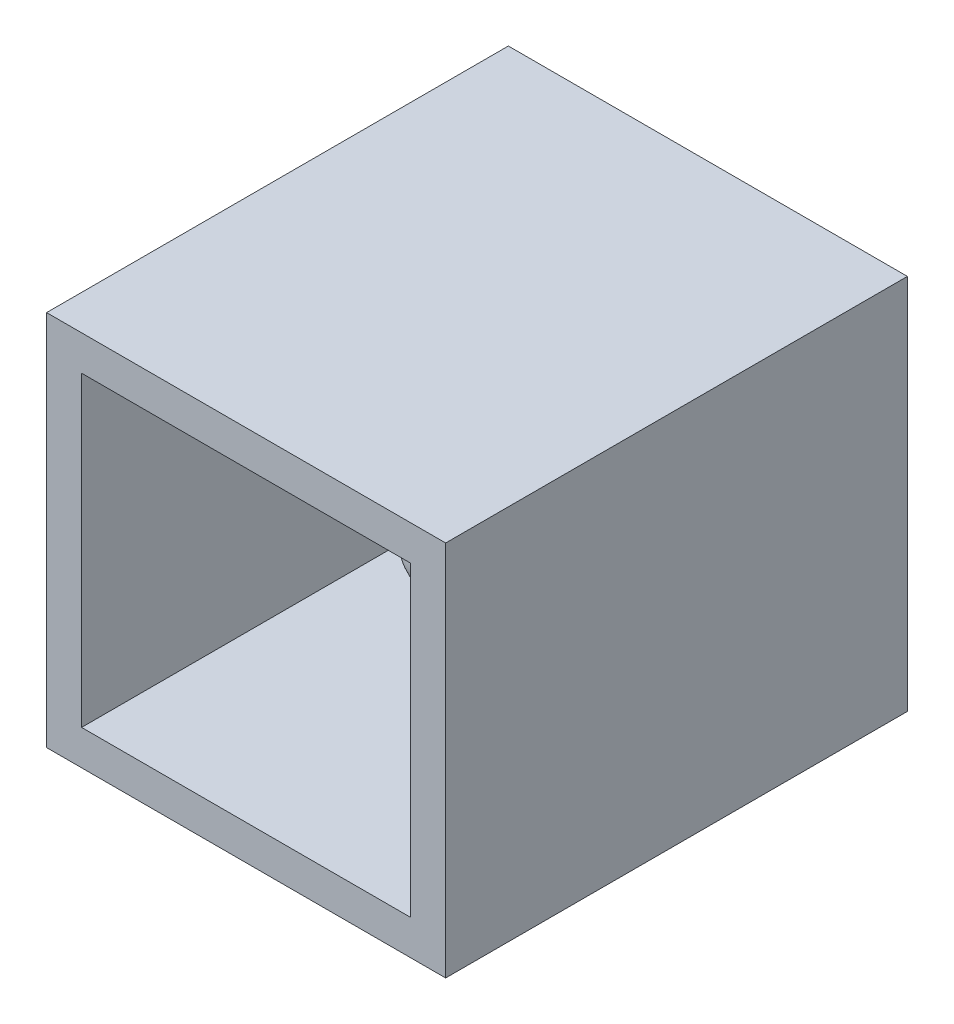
from build123d import *

# Parameters (mm, degrees)
SKETCH1_W           = 114.078277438
SKETCH1_H           = 107.698631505
SKETCH1_W_2         = 94.078277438
SKETCH1_H_2         = 87.698631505
EXTRUDE_THIN1_DEPTH = 122
SKETCH2_W           = 114.078277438
SKETCH2_H           = 107.698631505
BOSS_EXTRUDE1_DEPTH = 10


with BuildPart() as part:
    # Sketch1 → Extrude-Thin1 (new body)
    with BuildSketch(Plane.XY):
        with Locations((0.411844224, 43.849315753)):
            Rectangle(SKETCH1_W, SKETCH1_H)
        with Locations((0.411844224, 43.849315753)):
            Rectangle(SKETCH1_W_2, SKETCH1_H_2, mode=Mode.SUBTRACT)
    extrude(amount=EXTRUDE_THIN1_DEPTH)

    # Sketch2 → Boss-Extrude1 (add)
    with BuildSketch(Plane(origin=(0, 0, 0), x_dir=(-1, 0, 0), z_dir=(0, 0, -1))):
        with Locations((-0.411844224, 43.849315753)):
            Rectangle(SKETCH2_W, SKETCH2_H)
    extrude(amount=BOSS_EXTRUDE1_DEPTH)


with BuildPart() as body_2:
    # Sketch3 → Revolve1 (revolve)
    with BuildSketch(Plane(origin=(0, 0, 0), x_dir=(0, 0, -1), z_dir=(1, 0, 0))):
        with BuildLine():
            Line((-59.685447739, 51.480250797), (-59.685447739, 25.555978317))
            ThreePointArc((-59.685447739, 25.555978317), (-46.723311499, 38.518114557), (-59.685447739, 51.480250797))
        make_face()
    revolve(axis=Axis((0, 51.480250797, 59.685447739), (0, -1, 0)))


solid = Compound([part.part, body_2.part])
